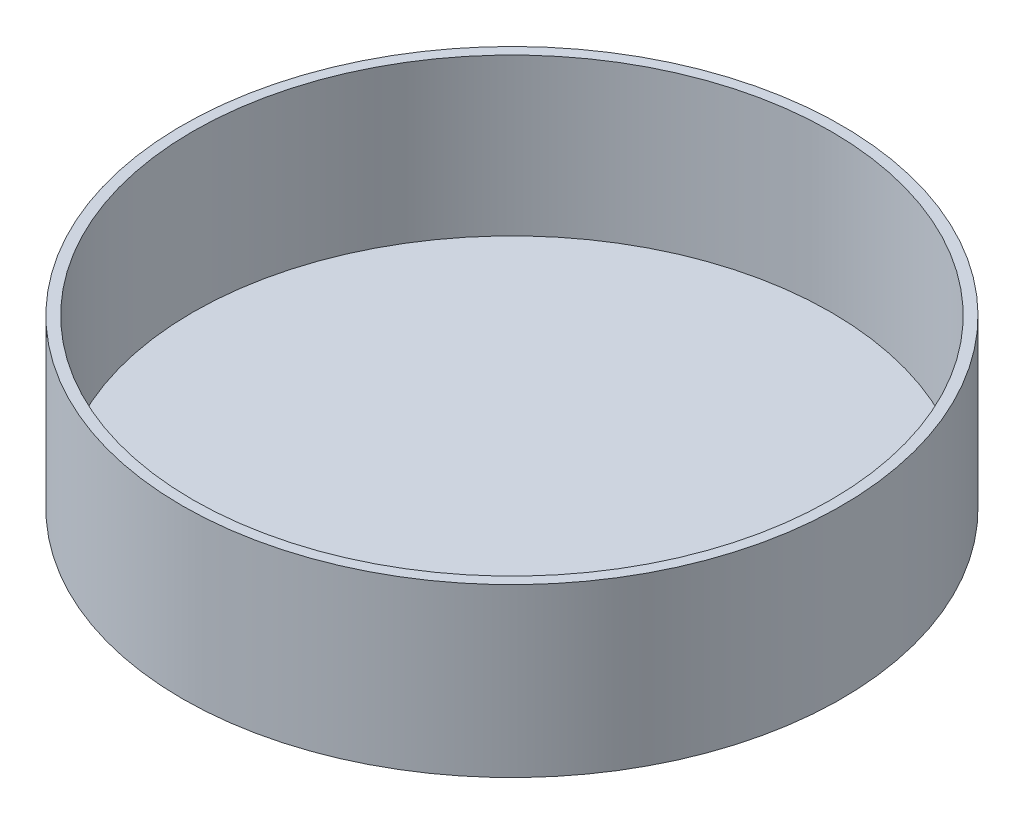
from build123d import *

# Parameters (mm, degrees)
SKETCH1_R      = 26.765
EXTRUDE1_DEPTH = 0.85
SKETCH2_R      = 26.765
SKETCH2_R_2    = 25.915
EXTRUDE2_DEPTH = 12.72


with BuildPart() as part:
    # Sketch1 → Extrude1 (new body)
    with BuildSketch(Plane(origin=(0, 0, 0), x_dir=(1, 0, 0), z_dir=(0, 1, 0))):
        with Locations(Location((0, 0, 0), (0, 0, 270))):
            Circle(SKETCH1_R)
    extrude(amount=EXTRUDE1_DEPTH)

    # Sketch2 → Extrude2 (add)
    with BuildSketch(Plane(origin=(0, 0.85, 0), x_dir=(-1, 0, 0), z_dir=(0, 1, 0))):
        with Locations(Location((0, 0, 0), (0, 0, 90))):
            Circle(SKETCH2_R)
        with Locations(Location((0, 0, 0), (0, 0, 270))):
            Circle(SKETCH2_R_2, mode=Mode.SUBTRACT)
    extrude(amount=EXTRUDE2_DEPTH)


solid = part.part
